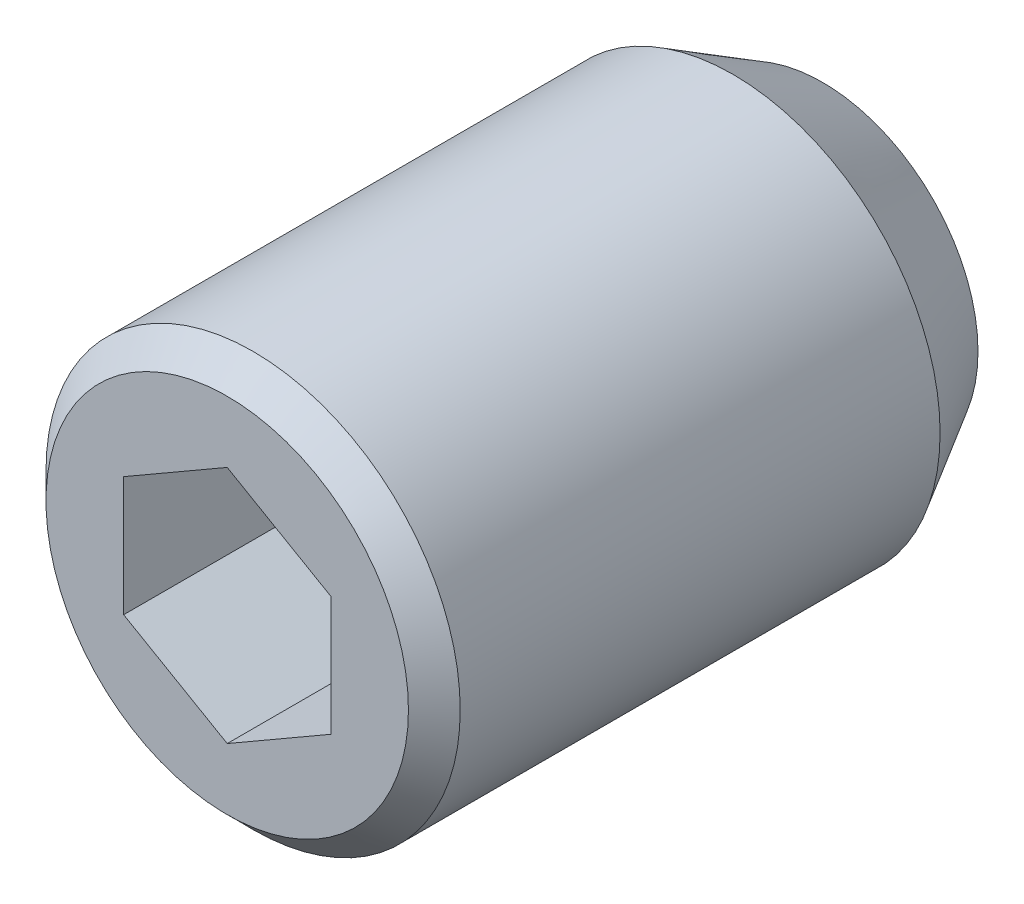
ISO-10303-21;
HEADER;
FILE_DESCRIPTION(('STEP AP214'),'2;1');
FILE_NAME('part.step','',(''),(''),'','','');
FILE_SCHEMA(('AUTOMOTIVE_DESIGN { 1 0 10303 214 1 1 1 1 }'));
ENDSEC;
DATA;
#1=APPLICATION_CONTEXT('core data for automotive mechanical design processes');
#2=APPLICATION_PROTOCOL_DEFINITION('international standard','automotive_design',2000,#1);
#3=PRODUCT_CONTEXT('',#1,'mechanical');
#4=PRODUCT('Part','Part','',(#3));
#5=PRODUCT_RELATED_PRODUCT_CATEGORY('part','',(#4));
#6=PRODUCT_DEFINITION_FORMATION('','',#4);
#7=PRODUCT_DEFINITION_CONTEXT('part definition',#1,'design');
#8=PRODUCT_DEFINITION('design','',#6,#7);
#9=PRODUCT_DEFINITION_SHAPE('','',#8);
#10=(LENGTH_UNIT() NAMED_UNIT(*) SI_UNIT(.MILLI.,.METRE.));
#11=(NAMED_UNIT(*) PLANE_ANGLE_UNIT() SI_UNIT($,.RADIAN.));
#12=(NAMED_UNIT(*) SI_UNIT($,.STERADIAN.) SOLID_ANGLE_UNIT());
#13=UNCERTAINTY_MEASURE_WITH_UNIT(LENGTH_MEASURE(1.E-05),#10,'distance_accuracy_value','');
#14=(GEOMETRIC_REPRESENTATION_CONTEXT(3) GLOBAL_UNCERTAINTY_ASSIGNED_CONTEXT((#13)) GLOBAL_UNIT_ASSIGNED_CONTEXT((#10,
#11,#12)) REPRESENTATION_CONTEXT('',''));
#15=CARTESIAN_POINT('',(0.,0.,0.));
#16=DIRECTION('',(0.,0.,1.));
#17=DIRECTION('',(1.,0.,0.));
#18=AXIS2_PLACEMENT_3D('',#15,#16,#17);
#19=CARTESIAN_POINT('',(1.,0.577350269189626,4.5));
#20=DIRECTION('',(0.5,0.866025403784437,0.));
#21=DIRECTION('',(0.866025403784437,-0.5,0.));
#22=AXIS2_PLACEMENT_3D('',#19,#20,#21);
#23=PLANE('',#22);
#24=DIRECTION('',(0.,0.,1.));
#25=VECTOR('',#24,1.);
#26=CARTESIAN_POINT('',(1.,0.577350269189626,4.5));
#27=LINE('',#26,#25);
#28=CARTESIAN_POINT('',(1.,0.577350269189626,4.5));
#29=VERTEX_POINT('',#28);
#30=CARTESIAN_POINT('',(1.,0.577350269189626,6.5));
#31=VERTEX_POINT('',#30);
#32=EDGE_CURVE('E96',#29,#31,#27,.T.);
#33=ORIENTED_EDGE('',*,*,#32,.T.);
#34=DIRECTION('',(-0.866025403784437,0.5,0.));
#35=VECTOR('',#34,1.);
#36=CARTESIAN_POINT('',(1.,0.577350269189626,6.5));
#37=LINE('',#36,#35);
#38=CARTESIAN_POINT('',(0.,1.15470053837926,6.5));
#39=VERTEX_POINT('',#38);
#40=EDGE_CURVE('E29',#31,#39,#37,.T.);
#41=ORIENTED_EDGE('',*,*,#40,.T.);
#42=DIRECTION('',(0.,0.,1.));
#43=VECTOR('',#42,1.);
#44=CARTESIAN_POINT('',(0.,1.15470053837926,4.5));
#45=LINE('',#44,#43);
#46=CARTESIAN_POINT('',(0.,1.15470053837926,4.5));
#47=VERTEX_POINT('',#46);
#48=EDGE_CURVE('E34',#47,#39,#45,.T.);
#49=ORIENTED_EDGE('',*,*,#48,.F.);
#50=DIRECTION('',(-0.866025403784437,0.5,0.));
#51=VECTOR('',#50,1.);
#52=CARTESIAN_POINT('',(1.,0.577350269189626,4.5));
#53=LINE('',#52,#51);
#54=EDGE_CURVE('E90',#29,#47,#53,.T.);
#55=ORIENTED_EDGE('',*,*,#54,.F.);
#56=EDGE_LOOP('',(#33,#41,#49,#55));
#57=FACE_BOUND('',#56,.T.);
#58=ADVANCED_FACE('F14',(#57),#23,.F.);
#59=CARTESIAN_POINT('',(1.,-0.577350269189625,4.5));
#60=DIRECTION('',(1.,0.,0.));
#61=DIRECTION('',(0.,-1.,0.));
#62=AXIS2_PLACEMENT_3D('',#59,#60,#61);
#63=PLANE('',#62);
#64=DIRECTION('',(0.,0.,1.));
#65=VECTOR('',#64,1.);
#66=CARTESIAN_POINT('',(1.,-0.577350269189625,4.5));
#67=LINE('',#66,#65);
#68=CARTESIAN_POINT('',(1.,-0.577350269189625,4.5));
#69=VERTEX_POINT('',#68);
#70=CARTESIAN_POINT('',(1.,-0.577350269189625,6.5));
#71=VERTEX_POINT('',#70);
#72=EDGE_CURVE('E93',#69,#71,#67,.T.);
#73=ORIENTED_EDGE('',*,*,#72,.T.);
#74=DIRECTION('',(0.,1.,0.));
#75=VECTOR('',#74,1.);
#76=CARTESIAN_POINT('',(1.,-0.577350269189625,6.5));
#77=LINE('',#76,#75);
#78=EDGE_CURVE('E156',#71,#31,#77,.T.);
#79=ORIENTED_EDGE('',*,*,#78,.T.);
#80=ORIENTED_EDGE('',*,*,#32,.F.);
#81=DIRECTION('',(0.,1.,0.));
#82=VECTOR('',#81,1.);
#83=CARTESIAN_POINT('',(1.,-0.577350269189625,4.5));
#84=LINE('',#83,#82);
#85=EDGE_CURVE('E85',#69,#29,#84,.T.);
#86=ORIENTED_EDGE('',*,*,#85,.F.);
#87=EDGE_LOOP('',(#73,#79,#80,#86));
#88=FACE_BOUND('',#87,.T.);
#89=ADVANCED_FACE('F122',(#88),#63,.F.);
#90=CARTESIAN_POINT('',(1.,-0.577350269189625,4.5));
#91=DIRECTION('',(-0.5,0.866025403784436,0.));
#92=DIRECTION('',(0.866025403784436,0.5,0.));
#93=AXIS2_PLACEMENT_3D('',#90,#91,#92);
#94=PLANE('',#93);
#95=DIRECTION('',(0.,0.,1.));
#96=VECTOR('',#95,1.);
#97=CARTESIAN_POINT('',(0.,-1.15470053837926,4.5));
#98=LINE('',#97,#96);
#99=CARTESIAN_POINT('',(0.,-1.15470053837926,4.5));
#100=VERTEX_POINT('',#99);
#101=CARTESIAN_POINT('',(0.,-1.15470053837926,6.5));
#102=VERTEX_POINT('',#101);
#103=EDGE_CURVE('E68',#100,#102,#98,.T.);
#104=ORIENTED_EDGE('',*,*,#103,.T.);
#105=DIRECTION('',(-0.866025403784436,-0.5,0.));
#106=VECTOR('',#105,1.);
#107=CARTESIAN_POINT('',(1.,-0.577350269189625,6.5));
#108=LINE('',#107,#106);
#109=EDGE_CURVE('E148',#71,#102,#108,.T.);
#110=ORIENTED_EDGE('',*,*,#109,.F.);
#111=ORIENTED_EDGE('',*,*,#72,.F.);
#112=DIRECTION('',(-0.866025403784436,-0.5,0.));
#113=VECTOR('',#112,1.);
#114=CARTESIAN_POINT('',(1.,-0.577350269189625,4.5));
#115=LINE('',#114,#113);
#116=EDGE_CURVE('E83',#69,#100,#115,.T.);
#117=ORIENTED_EDGE('',*,*,#116,.T.);
#118=EDGE_LOOP('',(#104,#110,#111,#117));
#119=FACE_BOUND('',#118,.T.);
#120=ADVANCED_FACE('F127',(#119),#94,.T.);
#121=CARTESIAN_POINT('',(-1.,-0.577350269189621,4.5));
#122=DIRECTION('',(-0.5,-0.866025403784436,0.));
#123=DIRECTION('',(-0.866025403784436,0.5,0.));
#124=AXIS2_PLACEMENT_3D('',#121,#122,#123);
#125=PLANE('',#124);
#126=DIRECTION('',(0.,0.,1.));
#127=VECTOR('',#126,1.);
#128=CARTESIAN_POINT('',(-1.,-0.577350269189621,4.5));
#129=LINE('',#128,#127);
#130=CARTESIAN_POINT('',(-1.,-0.577350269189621,4.5));
#131=VERTEX_POINT('',#130);
#132=CARTESIAN_POINT('',(-1.,-0.577350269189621,6.5));
#133=VERTEX_POINT('',#132);
#134=EDGE_CURVE('E56',#131,#133,#129,.T.);
#135=ORIENTED_EDGE('',*,*,#134,.T.);
#136=DIRECTION('',(0.866025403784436,-0.5,0.));
#137=VECTOR('',#136,1.);
#138=CARTESIAN_POINT('',(-1.,-0.577350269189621,6.5));
#139=LINE('',#138,#137);
#140=EDGE_CURVE('E151',#133,#102,#139,.T.);
#141=ORIENTED_EDGE('',*,*,#140,.T.);
#142=ORIENTED_EDGE('',*,*,#103,.F.);
#143=DIRECTION('',(0.866025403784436,-0.5,0.));
#144=VECTOR('',#143,1.);
#145=CARTESIAN_POINT('',(-1.,-0.577350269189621,4.5));
#146=LINE('',#145,#144);
#147=EDGE_CURVE('E76',#131,#100,#146,.T.);
#148=ORIENTED_EDGE('',*,*,#147,.F.);
#149=EDGE_LOOP('',(#135,#141,#142,#148));
#150=FACE_BOUND('',#149,.T.);
#151=ADVANCED_FACE('F81',(#150),#125,.F.);
#152=CARTESIAN_POINT('',(-1.,-0.577350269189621,4.5));
#153=DIRECTION('',(1.,0.,0.));
#154=DIRECTION('',(0.,-1.,0.));
#155=AXIS2_PLACEMENT_3D('',#152,#153,#154);
#156=PLANE('',#155);
#157=DIRECTION('',(0.,0.,1.));
#158=VECTOR('',#157,1.);
#159=CARTESIAN_POINT('',(-1.,0.577350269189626,4.5));
#160=LINE('',#159,#158);
#161=CARTESIAN_POINT('',(-1.,0.577350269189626,4.5));
#162=VERTEX_POINT('',#161);
#163=CARTESIAN_POINT('',(-1.,0.577350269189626,6.5));
#164=VERTEX_POINT('',#163);
#165=EDGE_CURVE('E69',#162,#164,#160,.T.);
#166=ORIENTED_EDGE('',*,*,#165,.T.);
#167=DIRECTION('',(0.,1.,0.));
#168=VECTOR('',#167,1.);
#169=CARTESIAN_POINT('',(-1.,-0.577350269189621,6.5));
#170=LINE('',#169,#168);
#171=EDGE_CURVE('E63',#133,#164,#170,.T.);
#172=ORIENTED_EDGE('',*,*,#171,.F.);
#173=ORIENTED_EDGE('',*,*,#134,.F.);
#174=DIRECTION('',(0.,1.,0.));
#175=VECTOR('',#174,1.);
#176=CARTESIAN_POINT('',(-1.,-0.577350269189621,4.5));
#177=LINE('',#176,#175);
#178=EDGE_CURVE('E60',#131,#162,#177,.T.);
#179=ORIENTED_EDGE('',*,*,#178,.T.);
#180=EDGE_LOOP('',(#166,#172,#173,#179));
#181=FACE_BOUND('',#180,.T.);
#182=ADVANCED_FACE('F59',(#181),#156,.T.);
#183=CARTESIAN_POINT('',(-1.,0.577350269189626,4.5));
#184=DIRECTION('',(0.5,-0.866025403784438,0.));
#185=DIRECTION('',(-0.866025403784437,-0.5,0.));
#186=AXIS2_PLACEMENT_3D('',#183,#184,#185);
#187=PLANE('',#186);
#188=DIRECTION('',(0.866025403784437,0.5,0.));
#189=VECTOR('',#188,1.);
#190=CARTESIAN_POINT('',(-1.,0.577350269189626,4.5));
#191=LINE('',#190,#189);
#192=EDGE_CURVE('E79',#162,#47,#191,.T.);
#193=ORIENTED_EDGE('',*,*,#192,.T.);
#194=ORIENTED_EDGE('',*,*,#48,.T.);
#195=DIRECTION('',(0.866025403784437,0.5,0.));
#196=VECTOR('',#195,1.);
#197=CARTESIAN_POINT('',(-1.,0.577350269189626,6.5));
#198=LINE('',#197,#196);
#199=EDGE_CURVE('E163',#164,#39,#198,.T.);
#200=ORIENTED_EDGE('',*,*,#199,.F.);
#201=ORIENTED_EDGE('',*,*,#165,.F.);
#202=EDGE_LOOP('',(#193,#194,#200,#201));
#203=FACE_BOUND('',#202,.T.);
#204=ADVANCED_FACE('F120',(#203),#187,.T.);
#205=CARTESIAN_POINT('',(2.,0.,4.5));
#206=DIRECTION('',(0.,0.,1.));
#207=DIRECTION('',(-1.,0.,0.));
#208=AXIS2_PLACEMENT_3D('',#205,#206,#207);
#209=PLANE('',#208);
#210=ORIENTED_EDGE('',*,*,#54,.T.);
#211=ORIENTED_EDGE('',*,*,#192,.F.);
#212=ORIENTED_EDGE('',*,*,#178,.F.);
#213=ORIENTED_EDGE('',*,*,#147,.T.);
#214=ORIENTED_EDGE('',*,*,#116,.F.);
#215=ORIENTED_EDGE('',*,*,#85,.T.);
#216=EDGE_LOOP('',(#210,#211,#212,#213,#214,#215));
#217=FACE_BOUND('',#216,.T.);
#218=ADVANCED_FACE('F74',(#217),#209,.T.);
#219=CARTESIAN_POINT('',(0.,0.,6.25));
#220=DIRECTION('',(0.,0.,-1.));
#221=DIRECTION('',(1.,0.,0.));
#222=AXIS2_PLACEMENT_3D('',#219,#220,#221);
#223=CYLINDRICAL_SURFACE('',#222,2.);
#224=CARTESIAN_POINT('',(0.,0.,6.25));
#225=DIRECTION('',(0.,0.,-1.));
#226=DIRECTION('',(1.,0.,0.));
#227=AXIS2_PLACEMENT_3D('',#224,#225,#226);
#228=CIRCLE('',#227,2.);
#229=CARTESIAN_POINT('',(2.,0.,6.25));
#230=VERTEX_POINT('',#229);
#231=EDGE_CURVE('E22',#230,#230,#228,.T.);
#232=ORIENTED_EDGE('',*,*,#231,.T.);
#233=EDGE_LOOP('',(#232));
#234=FACE_BOUND('',#233,.T.);
#235=CARTESIAN_POINT('',(0.,0.,1.61602540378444));
#236=DIRECTION('',(0.,0.,-1.));
#237=DIRECTION('',(-1.,0.,0.));
#238=AXIS2_PLACEMENT_3D('',#235,#236,#237);
#239=CIRCLE('',#238,2.);
#240=CARTESIAN_POINT('',(-2.,0.,1.61602540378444));
#241=VERTEX_POINT('',#240);
#242=EDGE_CURVE('E175',#241,#241,#239,.T.);
#243=ORIENTED_EDGE('',*,*,#242,.F.);
#244=EDGE_LOOP('',(#243));
#245=FACE_BOUND('',#244,.T.);
#246=ADVANCED_FACE('F103',(#234,#245),#223,.T.);
#247=CARTESIAN_POINT('',(0.,0.,6.25));
#248=DIRECTION('',(0.,0.,-1.));
#249=DIRECTION('',(1.,0.,0.));
#250=AXIS2_PLACEMENT_3D('',#247,#248,#249);
#251=CONICAL_SURFACE('',#250,2.,0.785398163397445);
#252=CARTESIAN_POINT('',(0.,0.,6.5));
#253=DIRECTION('',(0.,0.,-1.));
#254=DIRECTION('',(1.,0.,0.));
#255=AXIS2_PLACEMENT_3D('',#252,#253,#254);
#256=CIRCLE('',#255,1.75);
#257=CARTESIAN_POINT('',(1.75,0.,6.5));
#258=VERTEX_POINT('',#257);
#259=EDGE_CURVE('E98',#258,#258,#256,.T.);
#260=ORIENTED_EDGE('',*,*,#259,.T.);
#261=EDGE_LOOP('',(#260));
#262=FACE_BOUND('',#261,.T.);
#263=ORIENTED_EDGE('',*,*,#231,.F.);
#264=EDGE_LOOP('',(#263));
#265=FACE_BOUND('',#264,.T.);
#266=ADVANCED_FACE('F106',(#262,#265),#251,.T.);
#267=CARTESIAN_POINT('',(0.,0.,6.5));
#268=DIRECTION('',(0.,0.,-1.));
#269=DIRECTION('',(1.,0.,0.));
#270=AXIS2_PLACEMENT_3D('',#267,#268,#269);
#271=PLANE('',#270);
#272=ORIENTED_EDGE('',*,*,#199,.T.);
#273=ORIENTED_EDGE('',*,*,#40,.F.);
#274=ORIENTED_EDGE('',*,*,#78,.F.);
#275=ORIENTED_EDGE('',*,*,#109,.T.);
#276=ORIENTED_EDGE('',*,*,#140,.F.);
#277=ORIENTED_EDGE('',*,*,#171,.T.);
#278=EDGE_LOOP('',(#272,#273,#274,#275,#276,#277));
#279=FACE_BOUND('',#278,.T.);
#280=ORIENTED_EDGE('',*,*,#259,.F.);
#281=EDGE_LOOP('',(#280));
#282=FACE_BOUND('',#281,.T.);
#283=ADVANCED_FACE('F108',(#279,#282),#271,.F.);
#284=CARTESIAN_POINT('',(0.,0.,0.75));
#285=DIRECTION('',(0.,0.,1.));
#286=DIRECTION('',(1.,0.,0.));
#287=AXIS2_PLACEMENT_3D('',#284,#285,#286);
#288=CONICAL_SURFACE('',#287,1.5,0.523598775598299);
#289=ORIENTED_EDGE('',*,*,#242,.T.);
#290=EDGE_LOOP('',(#289));
#291=FACE_BOUND('',#290,.T.);
#292=CARTESIAN_POINT('',(0.,0.,0.75));
#293=DIRECTION('',(0.,0.,-1.));
#294=DIRECTION('',(-1.,0.,0.));
#295=AXIS2_PLACEMENT_3D('',#292,#293,#294);
#296=CIRCLE('',#295,1.5);
#297=CARTESIAN_POINT('',(-1.5,0.,0.75));
#298=VERTEX_POINT('',#297);
#299=EDGE_CURVE('E158',#298,#298,#296,.T.);
#300=ORIENTED_EDGE('',*,*,#299,.F.);
#301=EDGE_LOOP('',(#300));
#302=FACE_BOUND('',#301,.T.);
#303=ADVANCED_FACE('F116',(#291,#302),#288,.T.);
#304=CARTESIAN_POINT('',(0.,0.,1.25));
#305=DIRECTION('',(0.,0.,-1.));
#306=DIRECTION('',(1.,0.,0.));
#307=AXIS2_PLACEMENT_3D('',#304,#305,#306);
#308=SPHERICAL_SURFACE('',#307,1.25);
#309=CARTESIAN_POINT('',(0.,0.,0.75));
#310=DIRECTION('',(0.,0.,-1.));
#311=DIRECTION('',(1.,0.,0.));
#312=AXIS2_PLACEMENT_3D('',#309,#310,#311);
#313=CIRCLE('',#312,1.14564392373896);
#314=CARTESIAN_POINT('',(1.14564392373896,0.,0.75));
#315=VERTEX_POINT('',#314);
#316=EDGE_CURVE('E9',#315,#315,#313,.T.);
#317=ORIENTED_EDGE('',*,*,#316,.T.);
#318=EDGE_LOOP('',(#317));
#319=FACE_BOUND('',#318,.T.);
#320=ADVANCED_FACE('F16',(#319),#308,.T.);
#321=CARTESIAN_POINT('',(1.42264973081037,0.,0.75));
#322=DIRECTION('',(0.,0.,1.));
#323=DIRECTION('',(-1.,0.,0.));
#324=AXIS2_PLACEMENT_3D('',#321,#322,#323);
#325=PLANE('',#324);
#326=ORIENTED_EDGE('',*,*,#316,.F.);
#327=EDGE_LOOP('',(#326));
#328=FACE_BOUND('',#327,.T.);
#329=ORIENTED_EDGE('',*,*,#299,.T.);
#330=EDGE_LOOP('',(#329));
#331=FACE_BOUND('',#330,.T.);
#332=ADVANCED_FACE('F183',(#328,#331),#325,.F.);
#333=CLOSED_SHELL('',(#58,#89,#120,#151,#182,#204,#218,#246,#266,#283,#303,#320,#332));
#334=MANIFOLD_SOLID_BREP('B1',#333);
#335=ADVANCED_BREP_SHAPE_REPRESENTATION('',(#18,#334),#14);
#336=SHAPE_DEFINITION_REPRESENTATION(#9,#335);
ENDSEC;
END-ISO-10303-21;
